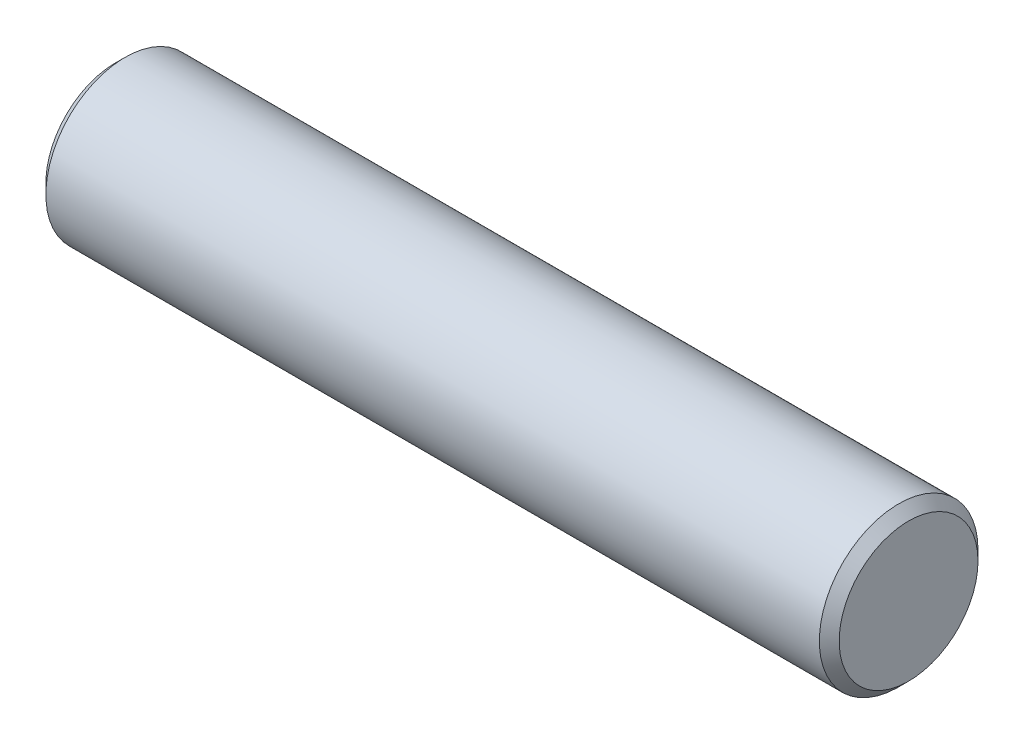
from build123d import *

# Parameters (mm, degrees)
ESQUISSE1_R        = 4
BOSS_EXTRU_1_DEPTH = 40
CHANFREIN1_SIZE    = 0.5


with BuildPart() as part:
    # Esquisse1 → Boss.-Extru.1 (new body)
    with BuildSketch(Plane(origin=(0, 0, 0), x_dir=(0, 0, -1), z_dir=(1, 0, 0))):
        Circle(ESQUISSE1_R)
    extrude(amount=BOSS_EXTRU_1_DEPTH)

    # Chanfrein1
    chanfrein1_edges = [part.edges().sort_by_distance(p)[0] for p in [
        (0, 0, 4),
        (40, 0, 4),
    ]]
    chamfer(chanfrein1_edges, length=CHANFREIN1_SIZE)


solid = part.part
